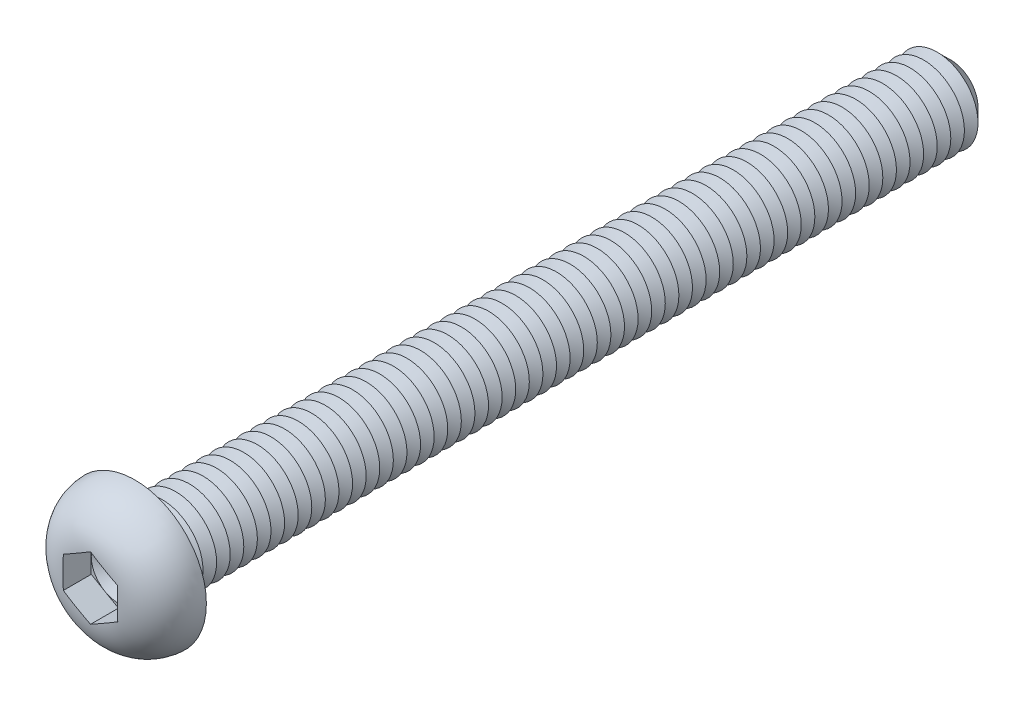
from build123d import *

# Parameters (mm, degrees)
CUT_EXTRUDE1_DEPTH  = 2.08
SKETCH4_R           = 3
BOSS_EXTRUDE1_DEPTH = 60
CHAMFER1_SIZE       = 1
LPATTERN1_COUNT     = 58
LPATTERN1_PITCH     = 1
FILLET2_R           = 0.5


with BuildPart() as part:
    # Sketch2 → Revolve1 (revolve)
    with BuildSketch(Plane(origin=(0, 0, 0), x_dir=(0, 0, -1), z_dir=(1, 0, 0)), mode=Mode.PRIVATE) as revolve1_sk:
        with BuildLine():
            Line((0, 0), (-3.3, 0))
            Line((-3.3, 0), (-3.3, 1.851470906))
            ThreePointArc((-3.3, 1.851470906), (-2.339262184, 4.220014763), (0, 5.25))
            Line((0, 5.25), (0, 0))
        make_face()
    revolve(revolve1_sk.sketch.rotate(Axis((0, 0, 47.934239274), (0, 0, -1)), 90), axis=Axis((0, 0, 47.934239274), (0, 0, -1)))

    # Sketch3 → Cut-Extrude1 (cut)
    with BuildSketch(Plane.XY.offset(3.3)):
        Polygon((0, 2.309401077), (-2, 1.154700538), (-2, -1.154700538), (0, -2.309401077), (2, -1.154700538), (2, 1.154700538), align=None)
    extrude(amount=-CUT_EXTRUDE1_DEPTH, mode=Mode.SUBTRACT)

    # Sketch4 → Boss-Extrude1 (add)
    with BuildSketch(Plane(origin=(0, 0, 0), x_dir=(-1, 0, 0), z_dir=(0, 0, -1))):
        Circle(SKETCH4_R)
    extrude(amount=BOSS_EXTRUDE1_DEPTH)

    # Chamfer1
    chamfer1_edges = [part.edges().sort_by_distance(p)[0] for p in [
        (3, 0, -60),
    ]]
    chamfer(chamfer1_edges, length=CHAMFER1_SIZE)

    # Sketch5 → Cut-Revolve1 (revolve, cut)
    with BuildSketch(Plane(origin=(0, 0, 0), x_dir=(0, 0, -1), z_dir=(1, 0, 0)), mode=Mode.PRIVATE) as cut_revolve1_sk:
        Polygon((1, 3), (2, 3), (1.5, 2.133974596), align=None)
    cut_revolve1 = revolve(cut_revolve1_sk.sketch.rotate(Axis((0, 0, 47.934239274), (0, 0, -1)), 90), axis=Axis((0, 0, 47.934239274), (0, 0, -1)), mode=Mode.SUBTRACT)

    # LPattern1: Cut-Revolve1 ×58
    with Locations(*[(0, 0, -i * LPATTERN1_PITCH) for i in range(1, LPATTERN1_COUNT)]):
        add(cut_revolve1, mode=Mode.SUBTRACT)

    # Fillet2
    fillet2_edges = [part.edges().sort_by_distance(p)[0] for p in [
        (3, 0, 0),
    ]]
    fillet(fillet2_edges, radius=FILLET2_R)

    # Cut-Extrude2 cone 1 section (on through the dimple's axis) → Cut-Extrude2 (revolve, cut)
    with BuildSketch(Plane(origin=(0, 0, 1.22), x_dir=(0, -1, 0), z_dir=(1, 0, 0))):
        Polygon((0, 0), (2, 0), (0, 1.154700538), align=None)
    revolve(axis=Axis((0, 0, 1.22), (0, 0, -1)), mode=Mode.SUBTRACT)


solid = part.part
